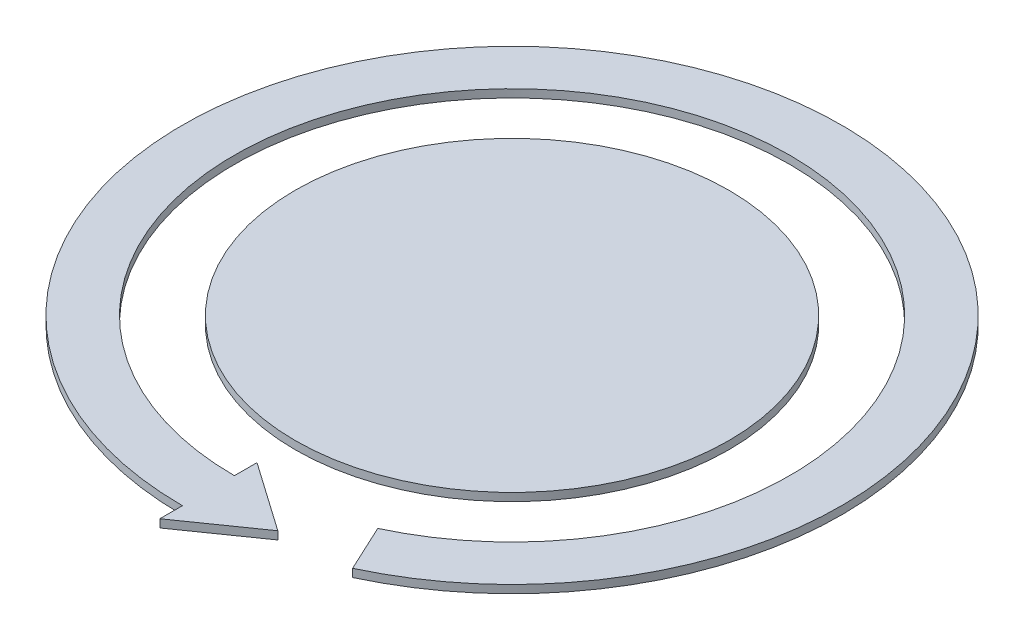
from build123d import *

# Parameters (mm, degrees)
SKIZZE1_R                         = 54.125
AUFSATZ_LINEAR_AUSTRAGEN1_DEPTH   = 2
AUFSATZ_LINEAR_AUSTRAGEN1_2_DEPTH = 2


with BuildPart() as part:
    # Skizze1 → Aufsatz-Linear austragen1 (new body)
    with BuildSketch(Plane(origin=(0, 0, 0), x_dir=(1, 0, 0), z_dir=(0, 1, 0))):
        with Locations(Location((0, 0, 0), (0, 0, 270))):
            Circle(SKIZZE1_R)
    extrude(amount=AUFSATZ_LINEAR_AUSTRAGEN1_DEPTH)


with BuildPart() as body_2:
    # Skizze1 → Aufsatz-Linear austragen1 2 (new body)
    with BuildSketch(Plane(origin=(0, 0, 0), x_dir=(1, 0, 0), z_dir=(0, 1, 0))):
        with BuildLine():
            Line((29.287445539, -62.807129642), (34.770917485, -74.566473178))
            ThreePointArc((34.770917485, -74.566473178), (-17.807569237, 80.324753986), (0, -82.275))
            Line((0, -82.275), (0, -87.914111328))
            Line((0, -87.914111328), (17.318595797, -75.7875))
            Line((17.318595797, -75.7875), (0, -63.660888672))
            Line((0, -63.660888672), (0, -69.3))
            ThreePointArc((0, -69.3), (-14.999265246, 67.657313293), (29.287445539, -62.807129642))
        make_face()
    extrude(amount=AUFSATZ_LINEAR_AUSTRAGEN1_2_DEPTH)


solid = Compound([part.part, body_2.part])
